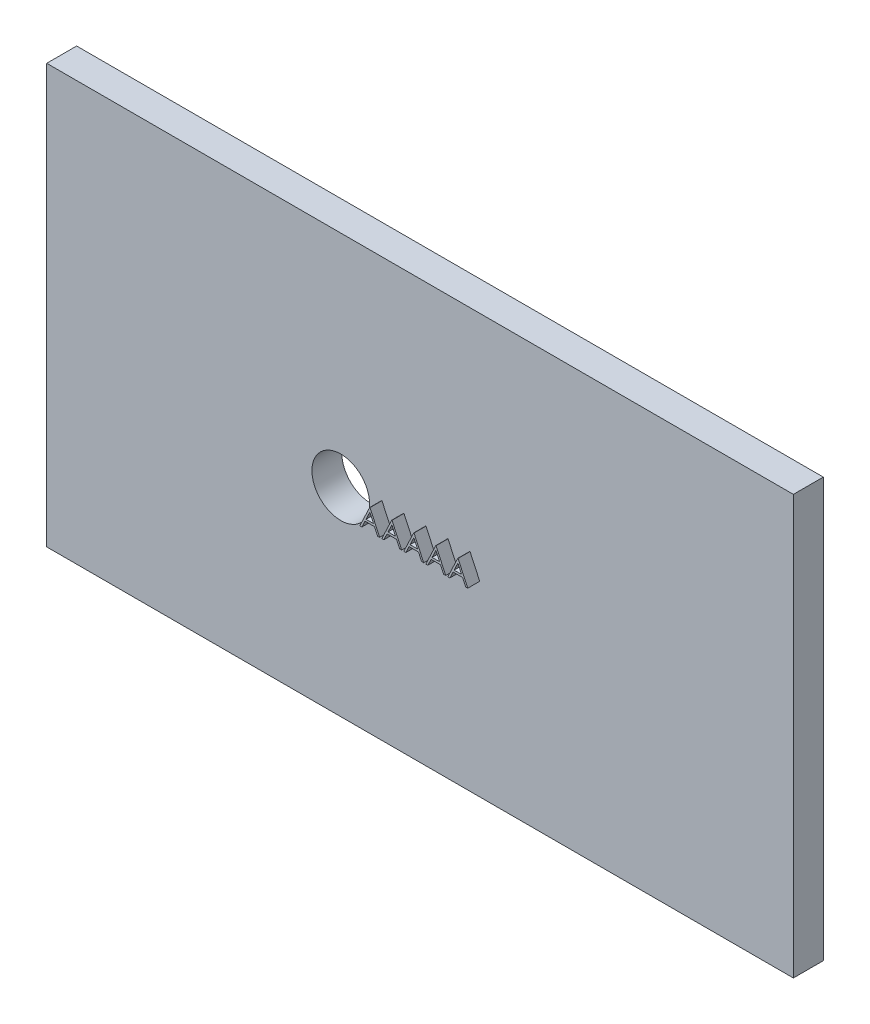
from build123d import *

# Parameters (mm, degrees)
SKIZZE1_W               = 124.744756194
SKIZZE1_H               = 69.97876567
SKIZZE1_R               = 4.814920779
LINEAR_AUSTRAGEN1_DEPTH = 5
LINEAR_AUSTRAGEN2_DEPTH = 2


with BuildPart() as part:
    # Skizze1 → Linear austragen1 (new body)
    with BuildSketch(Plane.XY):
        with Locations((62.372378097, 34.989382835)):
            Rectangle(SKIZZE1_W, SKIZZE1_H)
        with Locations((49.124450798, 33.196823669)):
            Circle(SKIZZE1_R, mode=Mode.SUBTRACT)
    extrude(amount=LINEAR_AUSTRAGEN1_DEPTH)

    # Skizze2 → Linear austragen2 (add)
    # profile 1 of 5: a face of its own
    with BuildSketch(Plane.XY.offset(5)):
        Polygon((56.009066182, 34.696823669), (57.624450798, 31.196823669), (57.283004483, 31.196823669), (56.765576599, 32.318618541), (55.178937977, 32.318618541), (54.646786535, 31.196823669), (54.303937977, 31.196823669), (55.964194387, 34.696823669), align=None)
        Polygon((55.983124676, 34.014632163), (55.349310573, 32.6775929), (56.600111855, 32.6775929), align=None, mode=Mode.SUBTRACT)
    # profile 2 of 5: a face of its own
    with BuildSketch(Plane.XY.offset(5)):
        Polygon((59.688553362, 34.696823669), (61.303937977, 31.196823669), (60.962491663, 31.196823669), (60.445063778, 32.318618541), (58.858425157, 32.318618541), (58.326273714, 31.196823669), (57.983425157, 31.196823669), (59.643681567, 34.696823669), align=None)
        Polygon((59.662611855, 34.014632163), (59.028797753, 32.6775929), (60.279599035, 32.6775929), align=None, mode=Mode.SUBTRACT)
    # profile 3 of 5: a face of its own
    with BuildSketch(Plane.XY.offset(5)):
        Polygon((63.368040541, 34.696823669), (64.983425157, 31.196823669), (64.641978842, 31.196823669), (64.124550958, 32.318618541), (62.537912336, 32.318618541), (62.005760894, 31.196823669), (61.662912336, 31.196823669), (63.323168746, 34.696823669), align=None)
        Polygon((63.342099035, 34.014632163), (62.708284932, 32.6775929), (63.959086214, 32.6775929), align=None, mode=Mode.SUBTRACT)
    # profile 4 of 5: a face of its own
    with BuildSketch(Plane.XY.offset(5)):
        Polygon((67.047527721, 34.696823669), (68.662912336, 31.196823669), (68.321466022, 31.196823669), (67.804038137, 32.318618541), (66.217399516, 32.318618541), (65.685248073, 31.196823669), (65.342399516, 31.196823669), (67.002655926, 34.696823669), align=None)
        Polygon((67.021586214, 34.014632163), (66.387772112, 32.6775929), (67.638573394, 32.6775929), align=None, mode=Mode.SUBTRACT)
    # profile 5 of 5: a face of its own
    with BuildSketch(Plane.XY.offset(5)):
        Polygon((70.7270149, 34.696823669), (72.342399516, 31.196823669), (72.000953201, 31.196823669), (71.483525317, 32.318618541), (69.896886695, 32.318618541), (69.364735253, 31.196823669), (69.021886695, 31.196823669), (70.682143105, 34.696823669), align=None)
        Polygon((70.701073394, 34.014632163), (70.067259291, 32.6775929), (71.318060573, 32.6775929), align=None, mode=Mode.SUBTRACT)
    extrude(amount=LINEAR_AUSTRAGEN2_DEPTH)


solid = part.part
